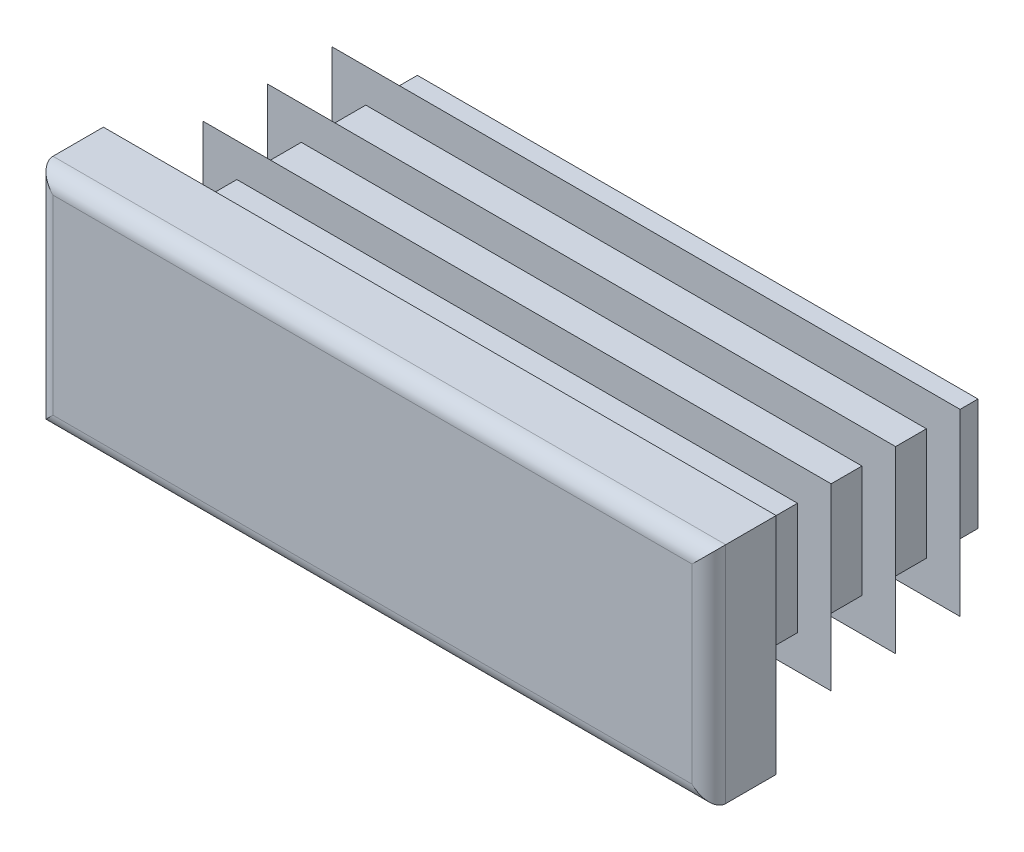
ISO-10303-21;
HEADER;
FILE_DESCRIPTION(('STEP AP214'),'2;1');
FILE_NAME('part.step','',(''),(''),'','','');
FILE_SCHEMA(('AUTOMOTIVE_DESIGN { 1 0 10303 214 1 1 1 1 }'));
ENDSEC;
DATA;
#1=APPLICATION_CONTEXT('core data for automotive mechanical design processes');
#2=APPLICATION_PROTOCOL_DEFINITION('international standard','automotive_design',2000,#1);
#3=PRODUCT_CONTEXT('',#1,'mechanical');
#4=PRODUCT('Part','Part','',(#3));
#5=PRODUCT_RELATED_PRODUCT_CATEGORY('part','',(#4));
#6=PRODUCT_DEFINITION_FORMATION('','',#4);
#7=PRODUCT_DEFINITION_CONTEXT('part definition',#1,'design');
#8=PRODUCT_DEFINITION('design','',#6,#7);
#9=PRODUCT_DEFINITION_SHAPE('','',#8);
#10=(LENGTH_UNIT() NAMED_UNIT(*) SI_UNIT(.MILLI.,.METRE.));
#11=(NAMED_UNIT(*) PLANE_ANGLE_UNIT() SI_UNIT($,.RADIAN.));
#12=(NAMED_UNIT(*) SI_UNIT($,.STERADIAN.) SOLID_ANGLE_UNIT());
#13=UNCERTAINTY_MEASURE_WITH_UNIT(LENGTH_MEASURE(1.E-05),#10,'distance_accuracy_value','');
#14=(GEOMETRIC_REPRESENTATION_CONTEXT(3) GLOBAL_UNCERTAINTY_ASSIGNED_CONTEXT((#13)) GLOBAL_UNIT_ASSIGNED_CONTEXT((#10,
#11,#12)) REPRESENTATION_CONTEXT('',''));
#15=CARTESIAN_POINT('',(0.,0.,0.));
#16=DIRECTION('',(0.,0.,1.));
#17=DIRECTION('',(1.,0.,0.));
#18=AXIS2_PLACEMENT_3D('',#15,#16,#17);
#19=CARTESIAN_POINT('',(14.25,-5.,3.));
#20=DIRECTION('',(0.,0.,-1.));
#21=DIRECTION('',(0.,1.,0.));
#22=AXIS2_PLACEMENT_3D('',#19,#20,#21);
#23=PLANE('',#22);
#24=DIRECTION('',(0.,1.,0.));
#25=VECTOR('',#24,1.);
#26=CARTESIAN_POINT('',(-14.25,-5.,3.));
#27=LINE('',#26,#25);
#28=CARTESIAN_POINT('',(-14.25,-4.25,3.));
#29=VERTEX_POINT('',#28);
#30=CARTESIAN_POINT('',(-14.25,4.25,3.));
#31=VERTEX_POINT('',#30);
#32=EDGE_CURVE('E310',#29,#31,#27,.T.);
#33=ORIENTED_EDGE('',*,*,#32,.F.);
#34=DIRECTION('',(-1.,0.,0.));
#35=VECTOR('',#34,1.);
#36=CARTESIAN_POINT('',(15.,-4.25,3.));
#37=LINE('',#36,#35);
#38=CARTESIAN_POINT('',(14.25,-4.25,3.));
#39=VERTEX_POINT('',#38);
#40=EDGE_CURVE('E482',#39,#29,#37,.T.);
#41=ORIENTED_EDGE('',*,*,#40,.F.);
#42=DIRECTION('',(0.,1.,0.));
#43=VECTOR('',#42,1.);
#44=CARTESIAN_POINT('',(14.25,-5.,3.));
#45=LINE('',#44,#43);
#46=CARTESIAN_POINT('',(14.25,4.25,3.));
#47=VERTEX_POINT('',#46);
#48=EDGE_CURVE('E305',#39,#47,#45,.T.);
#49=ORIENTED_EDGE('',*,*,#48,.T.);
#50=DIRECTION('',(-1.,0.,0.));
#51=VECTOR('',#50,1.);
#52=CARTESIAN_POINT('',(15.,4.25,3.));
#53=LINE('',#52,#51);
#54=EDGE_CURVE('E630',#47,#31,#53,.T.);
#55=ORIENTED_EDGE('',*,*,#54,.T.);
#56=EDGE_LOOP('',(#33,#41,#49,#55));
#57=FACE_BOUND('',#56,.T.);
#58=ADVANCED_FACE('F14',(#57),#23,.F.);
#59=CARTESIAN_POINT('',(-14.25,-5.,2.25));
#60=DIRECTION('',(0.,1.,0.));
#61=DIRECTION('',(-1.,0.,0.));
#62=AXIS2_PLACEMENT_3D('',#59,#60,#61);
#63=CYLINDRICAL_SURFACE('',#62,0.75);
#64=DIRECTION('',(0.,1.,0.));
#65=VECTOR('',#64,1.);
#66=CARTESIAN_POINT('',(-15.,-5.,2.25));
#67=LINE('',#66,#65);
#68=CARTESIAN_POINT('',(-15.,-5.,2.25));
#69=VERTEX_POINT('',#68);
#70=CARTESIAN_POINT('',(-15.,5.,2.25));
#71=VERTEX_POINT('',#70);
#72=EDGE_CURVE('E402',#69,#71,#67,.T.);
#73=ORIENTED_EDGE('',*,*,#72,.F.);
#74=CARTESIAN_POINT('',(-14.25,-4.25,2.25));
#75=DIRECTION('',(-0.707106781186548,0.707106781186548,0.));
#76=DIRECTION('',(0.707106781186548,0.707106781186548,0.));
#77=AXIS2_PLACEMENT_3D('',#74,#75,#76);
#78=ELLIPSE('',#77,1.06066017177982,0.75);
#79=EDGE_CURVE('E59',#69,#29,#78,.T.);
#80=ORIENTED_EDGE('',*,*,#79,.T.);
#81=ORIENTED_EDGE('',*,*,#32,.T.);
#82=CARTESIAN_POINT('',(-14.25,4.25,2.25));
#83=DIRECTION('',(0.707106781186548,0.707106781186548,0.));
#84=DIRECTION('',(-0.707106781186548,0.707106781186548,0.));
#85=AXIS2_PLACEMENT_3D('',#82,#83,#84);
#86=ELLIPSE('',#85,1.06066017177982,0.75);
#87=EDGE_CURVE('E306',#31,#71,#86,.F.);
#88=ORIENTED_EDGE('',*,*,#87,.T.);
#89=EDGE_LOOP('',(#73,#80,#81,#88));
#90=FACE_BOUND('',#89,.T.);
#91=ADVANCED_FACE('F16',(#90),#63,.T.);
#92=CARTESIAN_POINT('',(-15.,-5.,2.25));
#93=DIRECTION('',(1.,0.,0.));
#94=DIRECTION('',(0.,1.,0.));
#95=AXIS2_PLACEMENT_3D('',#92,#93,#94);
#96=PLANE('',#95);
#97=DIRECTION('',(0.,0.,-1.));
#98=VECTOR('',#97,1.);
#99=CARTESIAN_POINT('',(-15.,5.,2.25));
#100=LINE('',#99,#98);
#101=CARTESIAN_POINT('',(-15.,5.,0.));
#102=VERTEX_POINT('',#101);
#103=EDGE_CURVE('E615',#71,#102,#100,.T.);
#104=ORIENTED_EDGE('',*,*,#103,.T.);
#105=DIRECTION('',(0.,1.,0.));
#106=VECTOR('',#105,1.);
#107=CARTESIAN_POINT('',(-15.,-5.,0.));
#108=LINE('',#107,#106);
#109=CARTESIAN_POINT('',(-15.,-5.,0.));
#110=VERTEX_POINT('',#109);
#111=EDGE_CURVE('E400',#110,#102,#108,.T.);
#112=ORIENTED_EDGE('',*,*,#111,.F.);
#113=DIRECTION('',(0.,0.,-1.));
#114=VECTOR('',#113,1.);
#115=CARTESIAN_POINT('',(-15.,-5.,2.25));
#116=LINE('',#115,#114);
#117=EDGE_CURVE('E616',#69,#110,#116,.T.);
#118=ORIENTED_EDGE('',*,*,#117,.F.);
#119=ORIENTED_EDGE('',*,*,#72,.T.);
#120=EDGE_LOOP('',(#104,#112,#118,#119));
#121=FACE_BOUND('',#120,.T.);
#122=ADVANCED_FACE('F697',(#121),#96,.F.);
#123=CARTESIAN_POINT('',(-12.5,-5.,0.));
#124=DIRECTION('',(1.,0.,0.));
#125=DIRECTION('',(0.,1.,0.));
#126=AXIS2_PLACEMENT_3D('',#123,#124,#125);
#127=PLANE('',#126);
#128=DIRECTION('',(0.,1.,0.));
#129=VECTOR('',#128,1.);
#130=CARTESIAN_POINT('',(-12.5,-5.,0.));
#131=LINE('',#130,#129);
#132=CARTESIAN_POINT('',(-12.5,-2.5,0.));
#133=VERTEX_POINT('',#132);
#134=CARTESIAN_POINT('',(-12.5,2.5,0.));
#135=VERTEX_POINT('',#134);
#136=EDGE_CURVE('E397',#133,#135,#131,.T.);
#137=ORIENTED_EDGE('',*,*,#136,.T.);
#138=DIRECTION('',(0.,0.,-1.));
#139=VECTOR('',#138,1.);
#140=CARTESIAN_POINT('',(-12.5,2.5,0.));
#141=LINE('',#140,#139);
#142=CARTESIAN_POINT('',(-12.5,2.5,-0.575));
#143=VERTEX_POINT('',#142);
#144=EDGE_CURVE('E495',#135,#143,#141,.T.);
#145=ORIENTED_EDGE('',*,*,#144,.T.);
#146=DIRECTION('',(0.,1.,0.));
#147=VECTOR('',#146,1.);
#148=CARTESIAN_POINT('',(-12.5,-5.,-0.575));
#149=LINE('',#148,#147);
#150=CARTESIAN_POINT('',(-12.5,-2.5,-0.575));
#151=VERTEX_POINT('',#150);
#152=EDGE_CURVE('E394',#151,#143,#149,.T.);
#153=ORIENTED_EDGE('',*,*,#152,.F.);
#154=DIRECTION('',(0.,0.,1.));
#155=VECTOR('',#154,1.);
#156=CARTESIAN_POINT('',(-12.5,-2.5,0.));
#157=LINE('',#156,#155);
#158=EDGE_CURVE('E489',#151,#133,#157,.T.);
#159=ORIENTED_EDGE('',*,*,#158,.T.);
#160=EDGE_LOOP('',(#137,#145,#153,#159));
#161=FACE_BOUND('',#160,.T.);
#162=ADVANCED_FACE('F787',(#161),#127,.F.);
#163=CARTESIAN_POINT('',(-14.,-5.,-0.575));
#164=DIRECTION('',(0.342020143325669,0.,0.939692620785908));
#165=DIRECTION('',(-0.939692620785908,0.,0.342020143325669));
#166=AXIS2_PLACEMENT_3D('',#163,#164,#165);
#167=PLANE('',#166);
#168=DIRECTION('',(0.,1.,0.));
#169=VECTOR('',#168,1.);
#170=CARTESIAN_POINT('',(-14.,-5.,-0.575));
#171=LINE('',#170,#169);
#172=CARTESIAN_POINT('',(-14.,-4.,-0.575));
#173=VERTEX_POINT('',#172);
#174=CARTESIAN_POINT('',(-14.,4.,-0.575));
#175=VERTEX_POINT('',#174);
#176=EDGE_CURVE('E392',#173,#175,#171,.T.);
#177=ORIENTED_EDGE('',*,*,#176,.T.);
#178=DIRECTION('',(0.844349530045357,-0.438895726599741,-0.307318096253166));
#179=VECTOR('',#178,1.);
#180=CARTESIAN_POINT('',(-10.6647673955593,2.26633487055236,-1.78892539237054));
#181=LINE('',#180,#179);
#182=CARTESIAN_POINT('',(-12.5,3.22029495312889,-1.1209553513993));
#183=VERTEX_POINT('',#182);
#184=EDGE_CURVE('E519',#175,#183,#181,.T.);
#185=ORIENTED_EDGE('',*,*,#184,.T.);
#186=DIRECTION('',(0.,1.,0.));
#187=VECTOR('',#186,1.);
#188=CARTESIAN_POINT('',(-12.5,-5.,-1.1209553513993));
#189=LINE('',#188,#187);
#190=CARTESIAN_POINT('',(-12.5,-3.22029495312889,-1.1209553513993));
#191=VERTEX_POINT('',#190);
#192=EDGE_CURVE('E389',#191,#183,#189,.T.);
#193=ORIENTED_EDGE('',*,*,#192,.F.);
#194=DIRECTION('',(-0.844349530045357,-0.438895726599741,0.307318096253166));
#195=VECTOR('',#194,1.);
#196=CARTESIAN_POINT('',(-14.3705814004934,-4.19262945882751,-0.440119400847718));
#197=LINE('',#196,#195);
#198=EDGE_CURVE('E507',#191,#173,#197,.T.);
#199=ORIENTED_EDGE('',*,*,#198,.T.);
#200=EDGE_LOOP('',(#177,#185,#193,#199));
#201=FACE_BOUND('',#200,.T.);
#202=ADVANCED_FACE('F783',(#201),#167,.F.);
#203=CARTESIAN_POINT('',(-12.5,-5.,-1.1209553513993));
#204=DIRECTION('',(1.,0.,0.));
#205=DIRECTION('',(0.,1.,0.));
#206=AXIS2_PLACEMENT_3D('',#203,#204,#205);
#207=PLANE('',#206);
#208=ORIENTED_EDGE('',*,*,#192,.T.);
#209=DIRECTION('',(0.,-0.819152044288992,-0.573576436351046));
#210=VECTOR('',#209,1.);
#211=CARTESIAN_POINT('',(-12.5,-2.29560575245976,-4.98323060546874));
#212=LINE('',#211,#210);
#213=CARTESIAN_POINT('',(-12.5,2.5,-1.62531130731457));
#214=VERTEX_POINT('',#213);
#215=EDGE_CURVE('E516',#183,#214,#212,.T.);
#216=ORIENTED_EDGE('',*,*,#215,.T.);
#217=DIRECTION('',(0.,0.,-1.));
#218=VECTOR('',#217,1.);
#219=CARTESIAN_POINT('',(-12.5,2.5,-1.1209553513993));
#220=LINE('',#219,#218);
#221=CARTESIAN_POINT('',(-12.5,2.5,-3.45));
#222=VERTEX_POINT('',#221);
#223=EDGE_CURVE('E525',#214,#222,#220,.T.);
#224=ORIENTED_EDGE('',*,*,#223,.T.);
#225=DIRECTION('',(0.,1.,0.));
#226=VECTOR('',#225,1.);
#227=CARTESIAN_POINT('',(-12.5,-5.,-3.45));
#228=LINE('',#227,#226);
#229=CARTESIAN_POINT('',(-12.5,-2.5,-3.45));
#230=VERTEX_POINT('',#229);
#231=EDGE_CURVE('E386',#230,#222,#228,.T.);
#232=ORIENTED_EDGE('',*,*,#231,.F.);
#233=DIRECTION('',(0.,0.,1.));
#234=VECTOR('',#233,1.);
#235=CARTESIAN_POINT('',(-12.5,-2.5,-1.1209553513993));
#236=LINE('',#235,#234);
#237=CARTESIAN_POINT('',(-12.5,-2.5,-1.62531130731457));
#238=VERTEX_POINT('',#237);
#239=EDGE_CURVE('E522',#230,#238,#236,.T.);
#240=ORIENTED_EDGE('',*,*,#239,.T.);
#241=DIRECTION('',(0.,-0.819152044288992,0.573576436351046));
#242=VECTOR('',#241,1.);
#243=CARTESIAN_POINT('',(-12.5,-4.41449496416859,-0.284767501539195));
#244=LINE('',#243,#242);
#245=EDGE_CURVE('E504',#238,#191,#244,.T.);
#246=ORIENTED_EDGE('',*,*,#245,.T.);
#247=EDGE_LOOP('',(#208,#216,#224,#232,#240,#246));
#248=FACE_BOUND('',#247,.T.);
#249=ADVANCED_FACE('F779',(#248),#207,.F.);
#250=CARTESIAN_POINT('',(-14.,-5.,-3.45));
#251=DIRECTION('',(0.342020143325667,0.,0.939692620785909));
#252=DIRECTION('',(-0.939692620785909,0.,0.342020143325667));
#253=AXIS2_PLACEMENT_3D('',#250,#251,#252);
#254=PLANE('',#253);
#255=DIRECTION('',(0.,1.,0.));
#256=VECTOR('',#255,1.);
#257=CARTESIAN_POINT('',(-14.,-5.,-3.45));
#258=LINE('',#257,#256);
#259=CARTESIAN_POINT('',(-14.,-4.,-3.45));
#260=VERTEX_POINT('',#259);
#261=CARTESIAN_POINT('',(-14.,4.,-3.45));
#262=VERTEX_POINT('',#261);
#263=EDGE_CURVE('E384',#260,#262,#258,.T.);
#264=ORIENTED_EDGE('',*,*,#263,.T.);
#265=DIRECTION('',(0.844349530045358,-0.438895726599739,-0.307318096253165));
#266=VECTOR('',#265,1.);
#267=CARTESIAN_POINT('',(-10.6647673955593,2.26633487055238,-4.66392539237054));
#268=LINE('',#267,#266);
#269=CARTESIAN_POINT('',(-12.5,3.22029495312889,-3.99595535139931));
#270=VERTEX_POINT('',#269);
#271=EDGE_CURVE('E549',#262,#270,#268,.T.);
#272=ORIENTED_EDGE('',*,*,#271,.T.);
#273=DIRECTION('',(0.,1.,0.));
#274=VECTOR('',#273,1.);
#275=CARTESIAN_POINT('',(-12.5,-5.,-3.99595535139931));
#276=LINE('',#275,#274);
#277=CARTESIAN_POINT('',(-12.5,-3.22029495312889,-3.99595535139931));
#278=VERTEX_POINT('',#277);
#279=EDGE_CURVE('E381',#278,#270,#276,.T.);
#280=ORIENTED_EDGE('',*,*,#279,.F.);
#281=DIRECTION('',(-0.844349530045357,-0.43889572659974,0.307318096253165));
#282=VECTOR('',#281,1.);
#283=CARTESIAN_POINT('',(-14.3705814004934,-4.19262945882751,-3.31511940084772));
#284=LINE('',#283,#282);
#285=EDGE_CURVE('E537',#278,#260,#284,.T.);
#286=ORIENTED_EDGE('',*,*,#285,.T.);
#287=EDGE_LOOP('',(#264,#272,#280,#286));
#288=FACE_BOUND('',#287,.T.);
#289=ADVANCED_FACE('F775',(#288),#254,.F.);
#290=CARTESIAN_POINT('',(-12.5,-5.,-3.99595535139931));
#291=DIRECTION('',(1.,0.,0.));
#292=DIRECTION('',(0.,1.,0.));
#293=AXIS2_PLACEMENT_3D('',#290,#291,#292);
#294=PLANE('',#293);
#295=ORIENTED_EDGE('',*,*,#279,.T.);
#296=DIRECTION('',(0.,-0.819152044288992,-0.573576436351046));
#297=VECTOR('',#296,1.);
#298=CARTESIAN_POINT('',(-12.5,-2.29560575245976,-7.85823060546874));
#299=LINE('',#298,#297);
#300=CARTESIAN_POINT('',(-12.5,2.5,-4.50031130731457));
#301=VERTEX_POINT('',#300);
#302=EDGE_CURVE('E546',#270,#301,#299,.T.);
#303=ORIENTED_EDGE('',*,*,#302,.T.);
#304=DIRECTION('',(0.,0.,-1.));
#305=VECTOR('',#304,1.);
#306=CARTESIAN_POINT('',(-12.5,2.5,-3.99595535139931));
#307=LINE('',#306,#305);
#308=CARTESIAN_POINT('',(-12.5,2.5,-6.325));
#309=VERTEX_POINT('',#308);
#310=EDGE_CURVE('E555',#301,#309,#307,.T.);
#311=ORIENTED_EDGE('',*,*,#310,.T.);
#312=DIRECTION('',(0.,1.,0.));
#313=VECTOR('',#312,1.);
#314=CARTESIAN_POINT('',(-12.5,-5.,-6.325));
#315=LINE('',#314,#313);
#316=CARTESIAN_POINT('',(-12.5,-2.5,-6.325));
#317=VERTEX_POINT('',#316);
#318=EDGE_CURVE('E378',#317,#309,#315,.T.);
#319=ORIENTED_EDGE('',*,*,#318,.F.);
#320=DIRECTION('',(0.,0.,1.));
#321=VECTOR('',#320,1.);
#322=CARTESIAN_POINT('',(-12.5,-2.5,-3.99595535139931));
#323=LINE('',#322,#321);
#324=CARTESIAN_POINT('',(-12.5,-2.5,-4.50031130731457));
#325=VERTEX_POINT('',#324);
#326=EDGE_CURVE('E552',#317,#325,#323,.T.);
#327=ORIENTED_EDGE('',*,*,#326,.T.);
#328=DIRECTION('',(0.,-0.819152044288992,0.573576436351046));
#329=VECTOR('',#328,1.);
#330=CARTESIAN_POINT('',(-12.5,-4.41449496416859,-3.1597675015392));
#331=LINE('',#330,#329);
#332=EDGE_CURVE('E534',#325,#278,#331,.T.);
#333=ORIENTED_EDGE('',*,*,#332,.T.);
#334=EDGE_LOOP('',(#295,#303,#311,#319,#327,#333));
#335=FACE_BOUND('',#334,.T.);
#336=ADVANCED_FACE('F771',(#335),#294,.F.);
#337=CARTESIAN_POINT('',(-14.,-5.,-6.325));
#338=DIRECTION('',(0.342020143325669,0.,0.939692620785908));
#339=DIRECTION('',(-0.939692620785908,0.,0.342020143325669));
#340=AXIS2_PLACEMENT_3D('',#337,#338,#339);
#341=PLANE('',#340);
#342=DIRECTION('',(0.,1.,0.));
#343=VECTOR('',#342,1.);
#344=CARTESIAN_POINT('',(-14.,-5.,-6.325));
#345=LINE('',#344,#343);
#346=CARTESIAN_POINT('',(-14.,-4.,-6.325));
#347=VERTEX_POINT('',#346);
#348=CARTESIAN_POINT('',(-14.,4.,-6.325));
#349=VERTEX_POINT('',#348);
#350=EDGE_CURVE('E376',#347,#349,#345,.T.);
#351=ORIENTED_EDGE('',*,*,#350,.T.);
#352=DIRECTION('',(0.844349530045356,-0.438895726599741,-0.307318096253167));
#353=VECTOR('',#352,1.);
#354=CARTESIAN_POINT('',(-10.6647673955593,2.26633487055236,-7.53892539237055));
#355=LINE('',#354,#353);
#356=CARTESIAN_POINT('',(-12.5,3.22029495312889,-6.8709553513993));
#357=VERTEX_POINT('',#356);
#358=EDGE_CURVE('E579',#349,#357,#355,.T.);
#359=ORIENTED_EDGE('',*,*,#358,.T.);
#360=DIRECTION('',(0.,1.,0.));
#361=VECTOR('',#360,1.);
#362=CARTESIAN_POINT('',(-12.5,-5.,-6.8709553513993));
#363=LINE('',#362,#361);
#364=CARTESIAN_POINT('',(-12.5,-3.22029495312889,-6.8709553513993));
#365=VERTEX_POINT('',#364);
#366=EDGE_CURVE('E373',#365,#357,#363,.T.);
#367=ORIENTED_EDGE('',*,*,#366,.F.);
#368=DIRECTION('',(-0.844349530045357,-0.43889572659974,0.307318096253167));
#369=VECTOR('',#368,1.);
#370=CARTESIAN_POINT('',(-14.3705814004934,-4.19262945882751,-6.19011940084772));
#371=LINE('',#370,#369);
#372=EDGE_CURVE('E567',#365,#347,#371,.T.);
#373=ORIENTED_EDGE('',*,*,#372,.T.);
#374=EDGE_LOOP('',(#351,#359,#367,#373));
#375=FACE_BOUND('',#374,.T.);
#376=ADVANCED_FACE('F767',(#375),#341,.F.);
#377=CARTESIAN_POINT('',(-12.5,-5.,-6.8709553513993));
#378=DIRECTION('',(1.,0.,0.));
#379=DIRECTION('',(0.,1.,0.));
#380=AXIS2_PLACEMENT_3D('',#377,#378,#379);
#381=PLANE('',#380);
#382=ORIENTED_EDGE('',*,*,#366,.T.);
#383=DIRECTION('',(0.,-0.819152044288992,-0.573576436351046));
#384=VECTOR('',#383,1.);
#385=CARTESIAN_POINT('',(-12.5,-2.29560575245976,-10.7332306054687));
#386=LINE('',#385,#384);
#387=CARTESIAN_POINT('',(-12.5,2.5,-7.37531130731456));
#388=VERTEX_POINT('',#387);
#389=EDGE_CURVE('E576',#357,#388,#386,.T.);
#390=ORIENTED_EDGE('',*,*,#389,.T.);
#391=DIRECTION('',(0.,0.,-1.));
#392=VECTOR('',#391,1.);
#393=CARTESIAN_POINT('',(-12.5,2.5,-6.8709553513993));
#394=LINE('',#393,#392);
#395=CARTESIAN_POINT('',(-12.5,2.5,-9.2));
#396=VERTEX_POINT('',#395);
#397=EDGE_CURVE('E585',#388,#396,#394,.T.);
#398=ORIENTED_EDGE('',*,*,#397,.T.);
#399=DIRECTION('',(0.,1.,0.));
#400=VECTOR('',#399,1.);
#401=CARTESIAN_POINT('',(-12.5,-5.,-9.2));
#402=LINE('',#401,#400);
#403=CARTESIAN_POINT('',(-12.5,-2.5,-9.2));
#404=VERTEX_POINT('',#403);
#405=EDGE_CURVE('E370',#404,#396,#402,.T.);
#406=ORIENTED_EDGE('',*,*,#405,.F.);
#407=DIRECTION('',(0.,0.,1.));
#408=VECTOR('',#407,1.);
#409=CARTESIAN_POINT('',(-12.5,-2.5,-6.8709553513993));
#410=LINE('',#409,#408);
#411=CARTESIAN_POINT('',(-12.5,-2.5,-7.37531130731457));
#412=VERTEX_POINT('',#411);
#413=EDGE_CURVE('E582',#404,#412,#410,.T.);
#414=ORIENTED_EDGE('',*,*,#413,.T.);
#415=DIRECTION('',(0.,-0.819152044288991,0.573576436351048));
#416=VECTOR('',#415,1.);
#417=CARTESIAN_POINT('',(-12.5,-4.41449496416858,-6.03476750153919));
#418=LINE('',#417,#416);
#419=EDGE_CURVE('E564',#412,#365,#418,.T.);
#420=ORIENTED_EDGE('',*,*,#419,.T.);
#421=EDGE_LOOP('',(#382,#390,#398,#406,#414,#420));
#422=FACE_BOUND('',#421,.T.);
#423=ADVANCED_FACE('F764',(#422),#381,.F.);
#424=CARTESIAN_POINT('',(-14.,-5.,-9.2));
#425=DIRECTION('',(0.342020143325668,0.,0.939692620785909));
#426=DIRECTION('',(-0.939692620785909,0.,0.342020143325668));
#427=AXIS2_PLACEMENT_3D('',#424,#425,#426);
#428=PLANE('',#427);
#429=DIRECTION('',(0.,1.,0.));
#430=VECTOR('',#429,1.);
#431=CARTESIAN_POINT('',(-14.,-5.,-9.2));
#432=LINE('',#431,#430);
#433=CARTESIAN_POINT('',(-14.,-4.,-9.2));
#434=VERTEX_POINT('',#433);
#435=CARTESIAN_POINT('',(-14.,4.,-9.2));
#436=VERTEX_POINT('',#435);
#437=EDGE_CURVE('E368',#434,#436,#432,.T.);
#438=ORIENTED_EDGE('',*,*,#437,.T.);
#439=DIRECTION('',(0.844349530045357,-0.438895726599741,-0.307318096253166));
#440=VECTOR('',#439,1.);
#441=CARTESIAN_POINT('',(-10.6647673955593,2.26633487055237,-10.4139253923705));
#442=LINE('',#441,#440);
#443=CARTESIAN_POINT('',(-12.5,3.22029495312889,-9.7459553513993));
#444=VERTEX_POINT('',#443);
#445=EDGE_CURVE('E607',#436,#444,#442,.T.);
#446=ORIENTED_EDGE('',*,*,#445,.T.);
#447=DIRECTION('',(0.,1.,0.));
#448=VECTOR('',#447,1.);
#449=CARTESIAN_POINT('',(-12.5,-5.,-9.7459553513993));
#450=LINE('',#449,#448);
#451=CARTESIAN_POINT('',(-12.5,-3.22029495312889,-9.7459553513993));
#452=VERTEX_POINT('',#451);
#453=EDGE_CURVE('E365',#452,#444,#450,.T.);
#454=ORIENTED_EDGE('',*,*,#453,.F.);
#455=DIRECTION('',(-0.844349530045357,-0.438895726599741,0.307318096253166));
#456=VECTOR('',#455,1.);
#457=CARTESIAN_POINT('',(-14.3705814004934,-4.19262945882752,-9.06511940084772));
#458=LINE('',#457,#456);
#459=EDGE_CURVE('E595',#452,#434,#458,.T.);
#460=ORIENTED_EDGE('',*,*,#459,.T.);
#461=EDGE_LOOP('',(#438,#446,#454,#460));
#462=FACE_BOUND('',#461,.T.);
#463=ADVANCED_FACE('F675',(#462),#428,.F.);
#464=CARTESIAN_POINT('',(-12.5,-5.,-9.7459553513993));
#465=DIRECTION('',(1.,0.,0.));
#466=DIRECTION('',(0.,1.,0.));
#467=AXIS2_PLACEMENT_3D('',#464,#465,#466);
#468=PLANE('',#467);
#469=ORIENTED_EDGE('',*,*,#453,.T.);
#470=DIRECTION('',(0.,-0.819152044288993,-0.573576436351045));
#471=VECTOR('',#470,1.);
#472=CARTESIAN_POINT('',(-12.5,-2.29560575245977,-13.6082306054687));
#473=LINE('',#472,#471);
#474=CARTESIAN_POINT('',(-12.5,2.5,-10.2503113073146));
#475=VERTEX_POINT('',#474);
#476=EDGE_CURVE('E604',#444,#475,#473,.T.);
#477=ORIENTED_EDGE('',*,*,#476,.T.);
#478=DIRECTION('',(0.,0.,-1.));
#479=VECTOR('',#478,1.);
#480=CARTESIAN_POINT('',(-12.5,2.5,-9.7459553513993));
#481=LINE('',#480,#479);
#482=CARTESIAN_POINT('',(-12.5,2.5,-11.5));
#483=VERTEX_POINT('',#482);
#484=EDGE_CURVE('E613',#475,#483,#481,.T.);
#485=ORIENTED_EDGE('',*,*,#484,.T.);
#486=DIRECTION('',(0.,1.,0.));
#487=VECTOR('',#486,1.);
#488=CARTESIAN_POINT('',(-12.5,-5.,-11.5));
#489=LINE('',#488,#487);
#490=CARTESIAN_POINT('',(-12.5,-2.5,-11.5));
#491=VERTEX_POINT('',#490);
#492=EDGE_CURVE('E362',#491,#483,#489,.T.);
#493=ORIENTED_EDGE('',*,*,#492,.F.);
#494=DIRECTION('',(0.,0.,1.));
#495=VECTOR('',#494,1.);
#496=CARTESIAN_POINT('',(-12.5,-2.5,-9.7459553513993));
#497=LINE('',#496,#495);
#498=CARTESIAN_POINT('',(-12.5,-2.5,-10.2503113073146));
#499=VERTEX_POINT('',#498);
#500=EDGE_CURVE('E610',#491,#499,#497,.T.);
#501=ORIENTED_EDGE('',*,*,#500,.T.);
#502=DIRECTION('',(0.,-0.819152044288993,0.573576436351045));
#503=VECTOR('',#502,1.);
#504=CARTESIAN_POINT('',(-12.5,-4.41449496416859,-8.9097675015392));
#505=LINE('',#504,#503);
#506=EDGE_CURVE('E592',#499,#452,#505,.T.);
#507=ORIENTED_EDGE('',*,*,#506,.T.);
#508=EDGE_LOOP('',(#469,#477,#485,#493,#501,#507));
#509=FACE_BOUND('',#508,.T.);
#510=ADVANCED_FACE('F677',(#509),#468,.F.);
#511=CARTESIAN_POINT('',(-12.5,-5.,-11.5));
#512=DIRECTION('',(0.,0.,1.));
#513=DIRECTION('',(0.,-1.,0.));
#514=AXIS2_PLACEMENT_3D('',#511,#512,#513);
#515=PLANE('',#514);
#516=ORIENTED_EDGE('',*,*,#492,.T.);
#517=DIRECTION('',(-1.,0.,0.));
#518=VECTOR('',#517,1.);
#519=CARTESIAN_POINT('',(15.,2.5,-11.5));
#520=LINE('',#519,#518);
#521=CARTESIAN_POINT('',(12.5,2.5,-11.5));
#522=VERTEX_POINT('',#521);
#523=EDGE_CURVE('E438',#522,#483,#520,.T.);
#524=ORIENTED_EDGE('',*,*,#523,.F.);
#525=DIRECTION('',(0.,1.,0.));
#526=VECTOR('',#525,1.);
#527=CARTESIAN_POINT('',(12.5,-5.,-11.5));
#528=LINE('',#527,#526);
#529=CARTESIAN_POINT('',(12.5,-2.5,-11.5));
#530=VERTEX_POINT('',#529);
#531=EDGE_CURVE('E359',#530,#522,#528,.T.);
#532=ORIENTED_EDGE('',*,*,#531,.F.);
#533=DIRECTION('',(-1.,0.,0.));
#534=VECTOR('',#533,1.);
#535=CARTESIAN_POINT('',(15.,-2.5,-11.5));
#536=LINE('',#535,#534);
#537=EDGE_CURVE('E436',#530,#491,#536,.T.);
#538=ORIENTED_EDGE('',*,*,#537,.T.);
#539=EDGE_LOOP('',(#516,#524,#532,#538));
#540=FACE_BOUND('',#539,.T.);
#541=ADVANCED_FACE('F435',(#540),#515,.F.);
#542=CARTESIAN_POINT('',(12.5,-5.,-11.5));
#543=DIRECTION('',(-1.,0.,0.));
#544=DIRECTION('',(0.,-1.,0.));
#545=AXIS2_PLACEMENT_3D('',#542,#543,#544);
#546=PLANE('',#545);
#547=DIRECTION('',(0.,0.,1.));
#548=VECTOR('',#547,1.);
#549=CARTESIAN_POINT('',(12.5,2.5,-11.5));
#550=LINE('',#549,#548);
#551=CARTESIAN_POINT('',(12.5,2.5,-10.2503113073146));
#552=VERTEX_POINT('',#551);
#553=EDGE_CURVE('E9',#522,#552,#550,.T.);
#554=ORIENTED_EDGE('',*,*,#553,.T.);
#555=DIRECTION('',(0.,0.819152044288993,0.573576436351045));
#556=VECTOR('',#555,1.);
#557=CARTESIAN_POINT('',(12.5,-3.11973715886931,-14.1852936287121));
#558=LINE('',#557,#556);
#559=CARTESIAN_POINT('',(12.5,3.22029495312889,-9.7459553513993));
#560=VERTEX_POINT('',#559);
#561=EDGE_CURVE('E601',#552,#560,#558,.T.);
#562=ORIENTED_EDGE('',*,*,#561,.T.);
#563=DIRECTION('',(0.,1.,0.));
#564=VECTOR('',#563,1.);
#565=CARTESIAN_POINT('',(12.5,-5.,-9.7459553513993));
#566=LINE('',#565,#564);
#567=CARTESIAN_POINT('',(12.5,-3.22029495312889,-9.7459553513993));
#568=VERTEX_POINT('',#567);
#569=EDGE_CURVE('E356',#568,#560,#566,.T.);
#570=ORIENTED_EDGE('',*,*,#569,.F.);
#571=DIRECTION('',(0.,0.819152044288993,-0.573576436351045));
#572=VECTOR('',#571,1.);
#573=CARTESIAN_POINT('',(12.5,-3.59036355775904,-9.48683052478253));
#574=LINE('',#573,#572);
#575=CARTESIAN_POINT('',(12.5,-2.5,-10.2503113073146));
#576=VERTEX_POINT('',#575);
#577=EDGE_CURVE('E428',#568,#576,#574,.T.);
#578=ORIENTED_EDGE('',*,*,#577,.T.);
#579=DIRECTION('',(0.,0.,-1.));
#580=VECTOR('',#579,1.);
#581=CARTESIAN_POINT('',(12.5,-2.5,-11.5));
#582=LINE('',#581,#580);
#583=EDGE_CURVE('E23',#576,#530,#582,.T.);
#584=ORIENTED_EDGE('',*,*,#583,.T.);
#585=ORIENTED_EDGE('',*,*,#531,.T.);
#586=EDGE_LOOP('',(#554,#562,#570,#578,#584,#585));
#587=FACE_BOUND('',#586,.T.);
#588=ADVANCED_FACE('F426',(#587),#546,.F.);
#589=CARTESIAN_POINT('',(12.5,-5.,-9.7459553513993));
#590=DIRECTION('',(-0.342020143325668,0.,0.939692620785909));
#591=DIRECTION('',(-0.939692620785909,0.,-0.342020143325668));
#592=AXIS2_PLACEMENT_3D('',#589,#590,#591);
#593=PLANE('',#592);
#594=ORIENTED_EDGE('',*,*,#569,.T.);
#595=DIRECTION('',(0.844349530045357,0.438895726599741,0.307318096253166));
#596=VECTOR('',#595,1.);
#597=CARTESIAN_POINT('',(9.45371158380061,1.63682398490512,-10.8547136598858));
#598=LINE('',#597,#596);
#599=CARTESIAN_POINT('',(14.,4.,-9.2));
#600=VERTEX_POINT('',#599);
#601=EDGE_CURVE('E598',#560,#600,#598,.T.);
#602=ORIENTED_EDGE('',*,*,#601,.T.);
#603=DIRECTION('',(0.,1.,0.));
#604=VECTOR('',#603,1.);
#605=CARTESIAN_POINT('',(14.,-5.,-9.2));
#606=LINE('',#605,#604);
#607=CARTESIAN_POINT('',(14.,-4.,-9.2));
#608=VERTEX_POINT('',#607);
#609=EDGE_CURVE('E353',#608,#600,#606,.T.);
#610=ORIENTED_EDGE('',*,*,#609,.F.);
#611=DIRECTION('',(-0.844349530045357,0.438895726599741,-0.307318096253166));
#612=VECTOR('',#611,1.);
#613=CARTESIAN_POINT('',(13.1595255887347,-3.56311857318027,-9.50590766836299));
#614=LINE('',#613,#612);
#615=EDGE_CURVE('E588',#608,#568,#614,.T.);
#616=ORIENTED_EDGE('',*,*,#615,.T.);
#617=EDGE_LOOP('',(#594,#602,#610,#616));
#618=FACE_BOUND('',#617,.T.);
#619=ADVANCED_FACE('F752',(#618),#593,.F.);
#620=CARTESIAN_POINT('',(14.,-5.,-9.2));
#621=DIRECTION('',(0.,0.,-1.));
#622=DIRECTION('',(0.,1.,0.));
#623=AXIS2_PLACEMENT_3D('',#620,#621,#622);
#624=PLANE('',#623);
#625=ORIENTED_EDGE('',*,*,#609,.T.);
#626=DIRECTION('',(-1.,0.,0.));
#627=VECTOR('',#626,1.);
#628=CARTESIAN_POINT('',(15.,4.,-9.2));
#629=LINE('',#628,#627);
#630=EDGE_CURVE('E444',#600,#436,#629,.T.);
#631=ORIENTED_EDGE('',*,*,#630,.T.);
#632=ORIENTED_EDGE('',*,*,#437,.F.);
#633=DIRECTION('',(-1.,0.,0.));
#634=VECTOR('',#633,1.);
#635=CARTESIAN_POINT('',(15.,-4.,-9.2));
#636=LINE('',#635,#634);
#637=EDGE_CURVE('E451',#608,#434,#636,.T.);
#638=ORIENTED_EDGE('',*,*,#637,.F.);
#639=EDGE_LOOP('',(#625,#631,#632,#638));
#640=FACE_BOUND('',#639,.T.);
#641=ORIENTED_EDGE('',*,*,#405,.T.);
#642=DIRECTION('',(-1.,0.,0.));
#643=VECTOR('',#642,1.);
#644=CARTESIAN_POINT('',(15.,2.5,-9.2));
#645=LINE('',#644,#643);
#646=CARTESIAN_POINT('',(12.5,2.5,-9.2));
#647=VERTEX_POINT('',#646);
#648=EDGE_CURVE('E663',#647,#396,#645,.T.);
#649=ORIENTED_EDGE('',*,*,#648,.F.);
#650=DIRECTION('',(0.,1.,0.));
#651=VECTOR('',#650,1.);
#652=CARTESIAN_POINT('',(12.5,-5.,-9.2));
#653=LINE('',#652,#651);
#654=CARTESIAN_POINT('',(12.5,-2.5,-9.2));
#655=VERTEX_POINT('',#654);
#656=EDGE_CURVE('E350',#655,#647,#653,.T.);
#657=ORIENTED_EDGE('',*,*,#656,.F.);
#658=DIRECTION('',(-1.,0.,0.));
#659=VECTOR('',#658,1.);
#660=CARTESIAN_POINT('',(15.,-2.5,-9.2));
#661=LINE('',#660,#659);
#662=EDGE_CURVE('E453',#655,#404,#661,.T.);
#663=ORIENTED_EDGE('',*,*,#662,.T.);
#664=EDGE_LOOP('',(#641,#649,#657,#663));
#665=FACE_BOUND('',#664,.T.);
#666=ADVANCED_FACE('F667',(#640,#665),#624,.F.);
#667=CARTESIAN_POINT('',(12.5,-5.,-9.2));
#668=DIRECTION('',(-1.,0.,0.));
#669=DIRECTION('',(0.,-1.,0.));
#670=AXIS2_PLACEMENT_3D('',#667,#668,#669);
#671=PLANE('',#670);
#672=DIRECTION('',(0.,0.,1.));
#673=VECTOR('',#672,1.);
#674=CARTESIAN_POINT('',(12.5,2.5,-9.2));
#675=LINE('',#674,#673);
#676=CARTESIAN_POINT('',(12.5,2.5,-7.37531130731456));
#677=VERTEX_POINT('',#676);
#678=EDGE_CURVE('E420',#647,#677,#675,.T.);
#679=ORIENTED_EDGE('',*,*,#678,.T.);
#680=DIRECTION('',(0.,0.819152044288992,0.573576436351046));
#681=VECTOR('',#680,1.);
#682=CARTESIAN_POINT('',(12.5,-3.38989878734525,-11.4994628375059));
#683=LINE('',#682,#681);
#684=CARTESIAN_POINT('',(12.5,3.22029495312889,-6.8709553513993));
#685=VERTEX_POINT('',#684);
#686=EDGE_CURVE('E573',#677,#685,#683,.T.);
#687=ORIENTED_EDGE('',*,*,#686,.T.);
#688=DIRECTION('',(0.,1.,0.));
#689=VECTOR('',#688,1.);
#690=CARTESIAN_POINT('',(12.5,-5.,-6.8709553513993));
#691=LINE('',#690,#689);
#692=CARTESIAN_POINT('',(12.5,-3.22029495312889,-6.8709553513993));
#693=VERTEX_POINT('',#692);
#694=EDGE_CURVE('E347',#693,#685,#691,.T.);
#695=ORIENTED_EDGE('',*,*,#694,.F.);
#696=DIRECTION('',(0.,0.819152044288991,-0.573576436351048));
#697=VECTOR('',#696,1.);
#698=CARTESIAN_POINT('',(12.5,-3.32020192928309,-6.8009997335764));
#699=LINE('',#698,#697);
#700=CARTESIAN_POINT('',(12.5,-2.5,-7.37531130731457));
#701=VERTEX_POINT('',#700);
#702=EDGE_CURVE('E561',#693,#701,#699,.T.);
#703=ORIENTED_EDGE('',*,*,#702,.T.);
#704=DIRECTION('',(0.,0.,-1.));
#705=VECTOR('',#704,1.);
#706=CARTESIAN_POINT('',(12.5,-2.5,-9.2));
#707=LINE('',#706,#705);
#708=EDGE_CURVE('E417',#701,#655,#707,.T.);
#709=ORIENTED_EDGE('',*,*,#708,.T.);
#710=ORIENTED_EDGE('',*,*,#656,.T.);
#711=EDGE_LOOP('',(#679,#687,#695,#703,#709,#710));
#712=FACE_BOUND('',#711,.T.);
#713=ADVANCED_FACE('F745',(#712),#671,.F.);
#714=CARTESIAN_POINT('',(12.5,-5.,-6.8709553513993));
#715=DIRECTION('',(-0.342020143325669,0.,0.939692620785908));
#716=DIRECTION('',(-0.939692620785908,0.,-0.342020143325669));
#717=AXIS2_PLACEMENT_3D('',#714,#715,#716);
#718=PLANE('',#717);
#719=ORIENTED_EDGE('',*,*,#694,.T.);
#720=DIRECTION('',(0.844349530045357,0.43889572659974,0.307318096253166));
#721=VECTOR('',#720,1.);
#722=CARTESIAN_POINT('',(9.45371158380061,1.63682398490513,-7.97971365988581));
#723=LINE('',#722,#721);
#724=CARTESIAN_POINT('',(14.,4.,-6.325));
#725=VERTEX_POINT('',#724);
#726=EDGE_CURVE('E570',#685,#725,#723,.T.);
#727=ORIENTED_EDGE('',*,*,#726,.T.);
#728=DIRECTION('',(0.,1.,0.));
#729=VECTOR('',#728,1.);
#730=CARTESIAN_POINT('',(14.,-5.,-6.325));
#731=LINE('',#730,#729);
#732=CARTESIAN_POINT('',(14.,-4.,-6.325));
#733=VERTEX_POINT('',#732);
#734=EDGE_CURVE('E344',#733,#725,#731,.T.);
#735=ORIENTED_EDGE('',*,*,#734,.F.);
#736=DIRECTION('',(-0.844349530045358,0.438895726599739,-0.307318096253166));
#737=VECTOR('',#736,1.);
#738=CARTESIAN_POINT('',(13.1595255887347,-3.56311857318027,-6.63090766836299));
#739=LINE('',#738,#737);
#740=EDGE_CURVE('E558',#733,#693,#739,.T.);
#741=ORIENTED_EDGE('',*,*,#740,.T.);
#742=EDGE_LOOP('',(#719,#727,#735,#741));
#743=FACE_BOUND('',#742,.T.);
#744=ADVANCED_FACE('F741',(#743),#718,.F.);
#745=CARTESIAN_POINT('',(14.,-5.,-6.325));
#746=DIRECTION('',(0.,0.,-1.));
#747=DIRECTION('',(0.,1.,0.));
#748=AXIS2_PLACEMENT_3D('',#745,#746,#747);
#749=PLANE('',#748);
#750=ORIENTED_EDGE('',*,*,#734,.T.);
#751=DIRECTION('',(-1.,0.,0.));
#752=VECTOR('',#751,1.);
#753=CARTESIAN_POINT('',(15.,4.,-6.325));
#754=LINE('',#753,#752);
#755=EDGE_CURVE('E657',#725,#349,#754,.T.);
#756=ORIENTED_EDGE('',*,*,#755,.T.);
#757=ORIENTED_EDGE('',*,*,#350,.F.);
#758=DIRECTION('',(-1.,0.,0.));
#759=VECTOR('',#758,1.);
#760=CARTESIAN_POINT('',(15.,-4.,-6.325));
#761=LINE('',#760,#759);
#762=EDGE_CURVE('E459',#733,#347,#761,.T.);
#763=ORIENTED_EDGE('',*,*,#762,.F.);
#764=EDGE_LOOP('',(#750,#756,#757,#763));
#765=FACE_BOUND('',#764,.T.);
#766=ORIENTED_EDGE('',*,*,#318,.T.);
#767=DIRECTION('',(-1.,0.,0.));
#768=VECTOR('',#767,1.);
#769=CARTESIAN_POINT('',(15.,2.5,-6.325));
#770=LINE('',#769,#768);
#771=CARTESIAN_POINT('',(12.5,2.5,-6.325));
#772=VERTEX_POINT('',#771);
#773=EDGE_CURVE('E655',#772,#309,#770,.T.);
#774=ORIENTED_EDGE('',*,*,#773,.F.);
#775=DIRECTION('',(0.,1.,0.));
#776=VECTOR('',#775,1.);
#777=CARTESIAN_POINT('',(12.5,-5.,-6.325));
#778=LINE('',#777,#776);
#779=CARTESIAN_POINT('',(12.5,-2.5,-6.325));
#780=VERTEX_POINT('',#779);
#781=EDGE_CURVE('E341',#780,#772,#778,.T.);
#782=ORIENTED_EDGE('',*,*,#781,.F.);
#783=DIRECTION('',(-1.,0.,0.));
#784=VECTOR('',#783,1.);
#785=CARTESIAN_POINT('',(15.,-2.5,-6.325));
#786=LINE('',#785,#784);
#787=EDGE_CURVE('E461',#780,#317,#786,.T.);
#788=ORIENTED_EDGE('',*,*,#787,.T.);
#789=EDGE_LOOP('',(#766,#774,#782,#788));
#790=FACE_BOUND('',#789,.T.);
#791=ADVANCED_FACE('F737',(#765,#790),#749,.F.);
#792=CARTESIAN_POINT('',(12.5,-5.,-6.325));
#793=DIRECTION('',(-1.,0.,0.));
#794=DIRECTION('',(0.,-1.,0.));
#795=AXIS2_PLACEMENT_3D('',#792,#793,#794);
#796=PLANE('',#795);
#797=DIRECTION('',(0.,0.,1.));
#798=VECTOR('',#797,1.);
#799=CARTESIAN_POINT('',(12.5,2.5,-6.325));
#800=LINE('',#799,#798);
#801=CARTESIAN_POINT('',(12.5,2.5,-4.50031130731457));
#802=VERTEX_POINT('',#801);
#803=EDGE_CURVE('E414',#772,#802,#800,.T.);
#804=ORIENTED_EDGE('',*,*,#803,.T.);
#805=DIRECTION('',(0.,0.819152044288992,0.573576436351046));
#806=VECTOR('',#805,1.);
#807=CARTESIAN_POINT('',(12.5,-3.38989878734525,-8.62446283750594));
#808=LINE('',#807,#806);
#809=CARTESIAN_POINT('',(12.5,3.22029495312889,-3.99595535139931));
#810=VERTEX_POINT('',#809);
#811=EDGE_CURVE('E543',#802,#810,#808,.T.);
#812=ORIENTED_EDGE('',*,*,#811,.T.);
#813=DIRECTION('',(0.,1.,0.));
#814=VECTOR('',#813,1.);
#815=CARTESIAN_POINT('',(12.5,-5.,-3.99595535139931));
#816=LINE('',#815,#814);
#817=CARTESIAN_POINT('',(12.5,-3.22029495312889,-3.99595535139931));
#818=VERTEX_POINT('',#817);
#819=EDGE_CURVE('E338',#818,#810,#816,.T.);
#820=ORIENTED_EDGE('',*,*,#819,.F.);
#821=DIRECTION('',(0.,0.819152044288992,-0.573576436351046));
#822=VECTOR('',#821,1.);
#823=CARTESIAN_POINT('',(12.5,-3.32020192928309,-3.9259997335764));
#824=LINE('',#823,#822);
#825=CARTESIAN_POINT('',(12.5,-2.5,-4.50031130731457));
#826=VERTEX_POINT('',#825);
#827=EDGE_CURVE('E531',#818,#826,#824,.T.);
#828=ORIENTED_EDGE('',*,*,#827,.T.);
#829=DIRECTION('',(0.,0.,-1.));
#830=VECTOR('',#829,1.);
#831=CARTESIAN_POINT('',(12.5,-2.5,-6.325));
#832=LINE('',#831,#830);
#833=EDGE_CURVE('E411',#826,#780,#832,.T.);
#834=ORIENTED_EDGE('',*,*,#833,.T.);
#835=ORIENTED_EDGE('',*,*,#781,.T.);
#836=EDGE_LOOP('',(#804,#812,#820,#828,#834,#835));
#837=FACE_BOUND('',#836,.T.);
#838=ADVANCED_FACE('F733',(#837),#796,.F.);
#839=CARTESIAN_POINT('',(12.5,-5.,-3.99595535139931));
#840=DIRECTION('',(-0.342020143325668,0.,0.939692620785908));
#841=DIRECTION('',(-0.939692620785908,0.,-0.342020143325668));
#842=AXIS2_PLACEMENT_3D('',#839,#840,#841);
#843=PLANE('',#842);
#844=ORIENTED_EDGE('',*,*,#819,.T.);
#845=DIRECTION('',(0.844349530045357,0.438895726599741,0.307318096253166));
#846=VECTOR('',#845,1.);
#847=CARTESIAN_POINT('',(9.45371158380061,1.63682398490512,-5.10471365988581));
#848=LINE('',#847,#846);
#849=CARTESIAN_POINT('',(14.,4.,-3.45));
#850=VERTEX_POINT('',#849);
#851=EDGE_CURVE('E540',#810,#850,#848,.T.);
#852=ORIENTED_EDGE('',*,*,#851,.T.);
#853=DIRECTION('',(0.,1.,0.));
#854=VECTOR('',#853,1.);
#855=CARTESIAN_POINT('',(14.,-5.,-3.45));
#856=LINE('',#855,#854);
#857=CARTESIAN_POINT('',(14.,-4.,-3.45));
#858=VERTEX_POINT('',#857);
#859=EDGE_CURVE('E335',#858,#850,#856,.T.);
#860=ORIENTED_EDGE('',*,*,#859,.F.);
#861=DIRECTION('',(-0.844349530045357,0.438895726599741,-0.307318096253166));
#862=VECTOR('',#861,1.);
#863=CARTESIAN_POINT('',(13.1595255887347,-3.56311857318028,-3.75590766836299));
#864=LINE('',#863,#862);
#865=EDGE_CURVE('E528',#858,#818,#864,.T.);
#866=ORIENTED_EDGE('',*,*,#865,.T.);
#867=EDGE_LOOP('',(#844,#852,#860,#866));
#868=FACE_BOUND('',#867,.T.);
#869=ADVANCED_FACE('F729',(#868),#843,.F.);
#870=CARTESIAN_POINT('',(14.,-5.,-3.45));
#871=DIRECTION('',(0.,0.,-1.));
#872=DIRECTION('',(0.,1.,0.));
#873=AXIS2_PLACEMENT_3D('',#870,#871,#872);
#874=PLANE('',#873);
#875=ORIENTED_EDGE('',*,*,#859,.T.);
#876=DIRECTION('',(-1.,0.,0.));
#877=VECTOR('',#876,1.);
#878=CARTESIAN_POINT('',(15.,4.,-3.45));
#879=LINE('',#878,#877);
#880=EDGE_CURVE('E649',#850,#262,#879,.T.);
#881=ORIENTED_EDGE('',*,*,#880,.T.);
#882=ORIENTED_EDGE('',*,*,#263,.F.);
#883=DIRECTION('',(-1.,0.,0.));
#884=VECTOR('',#883,1.);
#885=CARTESIAN_POINT('',(15.,-4.,-3.45));
#886=LINE('',#885,#884);
#887=EDGE_CURVE('E467',#858,#260,#886,.T.);
#888=ORIENTED_EDGE('',*,*,#887,.F.);
#889=EDGE_LOOP('',(#875,#881,#882,#888));
#890=FACE_BOUND('',#889,.T.);
#891=ORIENTED_EDGE('',*,*,#231,.T.);
#892=DIRECTION('',(-1.,0.,0.));
#893=VECTOR('',#892,1.);
#894=CARTESIAN_POINT('',(15.,2.5,-3.45));
#895=LINE('',#894,#893);
#896=CARTESIAN_POINT('',(12.5,2.5,-3.45));
#897=VERTEX_POINT('',#896);
#898=EDGE_CURVE('E647',#897,#222,#895,.T.);
#899=ORIENTED_EDGE('',*,*,#898,.F.);
#900=DIRECTION('',(0.,1.,0.));
#901=VECTOR('',#900,1.);
#902=CARTESIAN_POINT('',(12.5,-5.,-3.45));
#903=LINE('',#902,#901);
#904=CARTESIAN_POINT('',(12.5,-2.5,-3.45));
#905=VERTEX_POINT('',#904);
#906=EDGE_CURVE('E332',#905,#897,#903,.T.);
#907=ORIENTED_EDGE('',*,*,#906,.F.);
#908=DIRECTION('',(-1.,0.,0.));
#909=VECTOR('',#908,1.);
#910=CARTESIAN_POINT('',(15.,-2.5,-3.45));
#911=LINE('',#910,#909);
#912=EDGE_CURVE('E469',#905,#230,#911,.T.);
#913=ORIENTED_EDGE('',*,*,#912,.T.);
#914=EDGE_LOOP('',(#891,#899,#907,#913));
#915=FACE_BOUND('',#914,.T.);
#916=ADVANCED_FACE('F725',(#890,#915),#874,.F.);
#917=CARTESIAN_POINT('',(12.5,-5.,-3.45));
#918=DIRECTION('',(-1.,0.,0.));
#919=DIRECTION('',(0.,-1.,0.));
#920=AXIS2_PLACEMENT_3D('',#917,#918,#919);
#921=PLANE('',#920);
#922=DIRECTION('',(0.,0.,1.));
#923=VECTOR('',#922,1.);
#924=CARTESIAN_POINT('',(12.5,2.5,-3.45));
#925=LINE('',#924,#923);
#926=CARTESIAN_POINT('',(12.5,2.5,-1.62531130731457));
#927=VERTEX_POINT('',#926);
#928=EDGE_CURVE('E408',#897,#927,#925,.T.);
#929=ORIENTED_EDGE('',*,*,#928,.T.);
#930=DIRECTION('',(0.,0.819152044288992,0.573576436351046));
#931=VECTOR('',#930,1.);
#932=CARTESIAN_POINT('',(12.5,-3.38989878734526,-5.74946283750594));
#933=LINE('',#932,#931);
#934=CARTESIAN_POINT('',(12.5,3.22029495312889,-1.1209553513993));
#935=VERTEX_POINT('',#934);
#936=EDGE_CURVE('E513',#927,#935,#933,.T.);
#937=ORIENTED_EDGE('',*,*,#936,.T.);
#938=DIRECTION('',(0.,1.,0.));
#939=VECTOR('',#938,1.);
#940=CARTESIAN_POINT('',(12.5,-5.,-1.1209553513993));
#941=LINE('',#940,#939);
#942=CARTESIAN_POINT('',(12.5,-3.22029495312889,-1.1209553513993));
#943=VERTEX_POINT('',#942);
#944=EDGE_CURVE('E329',#943,#935,#941,.T.);
#945=ORIENTED_EDGE('',*,*,#944,.F.);
#946=DIRECTION('',(0.,0.819152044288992,-0.573576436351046));
#947=VECTOR('',#946,1.);
#948=CARTESIAN_POINT('',(12.5,-3.32020192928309,-1.0509997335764));
#949=LINE('',#948,#947);
#950=CARTESIAN_POINT('',(12.5,-2.5,-1.62531130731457));
#951=VERTEX_POINT('',#950);
#952=EDGE_CURVE('E501',#943,#951,#949,.T.);
#953=ORIENTED_EDGE('',*,*,#952,.T.);
#954=DIRECTION('',(0.,0.,-1.));
#955=VECTOR('',#954,1.);
#956=CARTESIAN_POINT('',(12.5,-2.5,-3.45));
#957=LINE('',#956,#955);
#958=EDGE_CURVE('E405',#951,#905,#957,.T.);
#959=ORIENTED_EDGE('',*,*,#958,.T.);
#960=ORIENTED_EDGE('',*,*,#906,.T.);
#961=EDGE_LOOP('',(#929,#937,#945,#953,#959,#960));
#962=FACE_BOUND('',#961,.T.);
#963=ADVANCED_FACE('F721',(#962),#921,.F.);
#964=CARTESIAN_POINT('',(12.5,-5.,-1.1209553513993));
#965=DIRECTION('',(-0.342020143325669,0.,0.939692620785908));
#966=DIRECTION('',(-0.939692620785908,0.,-0.342020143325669));
#967=AXIS2_PLACEMENT_3D('',#964,#965,#966);
#968=PLANE('',#967);
#969=ORIENTED_EDGE('',*,*,#944,.T.);
#970=DIRECTION('',(0.844349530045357,0.438895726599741,0.307318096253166));
#971=VECTOR('',#970,1.);
#972=CARTESIAN_POINT('',(9.45371158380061,1.63682398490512,-2.22971365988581));
#973=LINE('',#972,#971);
#974=CARTESIAN_POINT('',(14.,4.,-0.575));
#975=VERTEX_POINT('',#974);
#976=EDGE_CURVE('E510',#935,#975,#973,.T.);
#977=ORIENTED_EDGE('',*,*,#976,.T.);
#978=DIRECTION('',(0.,1.,0.));
#979=VECTOR('',#978,1.);
#980=CARTESIAN_POINT('',(14.,-5.,-0.575));
#981=LINE('',#980,#979);
#982=CARTESIAN_POINT('',(14.,-4.,-0.575));
#983=VERTEX_POINT('',#982);
#984=EDGE_CURVE('E326',#983,#975,#981,.T.);
#985=ORIENTED_EDGE('',*,*,#984,.F.);
#986=DIRECTION('',(-0.844349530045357,0.438895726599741,-0.307318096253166));
#987=VECTOR('',#986,1.);
#988=CARTESIAN_POINT('',(13.1595255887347,-3.56311857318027,-0.880907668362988));
#989=LINE('',#988,#987);
#990=EDGE_CURVE('E498',#983,#943,#989,.T.);
#991=ORIENTED_EDGE('',*,*,#990,.T.);
#992=EDGE_LOOP('',(#969,#977,#985,#991));
#993=FACE_BOUND('',#992,.T.);
#994=ADVANCED_FACE('F717',(#993),#968,.F.);
#995=CARTESIAN_POINT('',(14.,-5.,-0.575));
#996=DIRECTION('',(0.,0.,-1.));
#997=DIRECTION('',(0.,1.,0.));
#998=AXIS2_PLACEMENT_3D('',#995,#996,#997);
#999=PLANE('',#998);
#1000=ORIENTED_EDGE('',*,*,#984,.T.);
#1001=DIRECTION('',(-1.,0.,0.));
#1002=VECTOR('',#1001,1.);
#1003=CARTESIAN_POINT('',(15.,4.,-0.575));
#1004=LINE('',#1003,#1002);
#1005=EDGE_CURVE('E641',#975,#175,#1004,.T.);
#1006=ORIENTED_EDGE('',*,*,#1005,.T.);
#1007=ORIENTED_EDGE('',*,*,#176,.F.);
#1008=DIRECTION('',(-1.,0.,0.));
#1009=VECTOR('',#1008,1.);
#1010=CARTESIAN_POINT('',(15.,-4.,-0.575));
#1011=LINE('',#1010,#1009);
#1012=EDGE_CURVE('E475',#983,#173,#1011,.T.);
#1013=ORIENTED_EDGE('',*,*,#1012,.F.);
#1014=EDGE_LOOP('',(#1000,#1006,#1007,#1013));
#1015=FACE_BOUND('',#1014,.T.);
#1016=ORIENTED_EDGE('',*,*,#152,.T.);
#1017=DIRECTION('',(-1.,0.,0.));
#1018=VECTOR('',#1017,1.);
#1019=CARTESIAN_POINT('',(15.,2.5,-0.575));
#1020=LINE('',#1019,#1018);
#1021=CARTESIAN_POINT('',(12.5,2.5,-0.575));
#1022=VERTEX_POINT('',#1021);
#1023=EDGE_CURVE('E639',#1022,#143,#1020,.T.);
#1024=ORIENTED_EDGE('',*,*,#1023,.F.);
#1025=DIRECTION('',(0.,1.,0.));
#1026=VECTOR('',#1025,1.);
#1027=CARTESIAN_POINT('',(12.5,-5.,-0.575));
#1028=LINE('',#1027,#1026);
#1029=CARTESIAN_POINT('',(12.5,-2.5,-0.575));
#1030=VERTEX_POINT('',#1029);
#1031=EDGE_CURVE('E323',#1030,#1022,#1028,.T.);
#1032=ORIENTED_EDGE('',*,*,#1031,.F.);
#1033=DIRECTION('',(-1.,0.,0.));
#1034=VECTOR('',#1033,1.);
#1035=CARTESIAN_POINT('',(15.,-2.5,-0.575));
#1036=LINE('',#1035,#1034);
#1037=EDGE_CURVE('E477',#1030,#151,#1036,.T.);
#1038=ORIENTED_EDGE('',*,*,#1037,.T.);
#1039=EDGE_LOOP('',(#1016,#1024,#1032,#1038));
#1040=FACE_BOUND('',#1039,.T.);
#1041=ADVANCED_FACE('F713',(#1015,#1040),#999,.F.);
#1042=CARTESIAN_POINT('',(12.5,-5.,-0.575));
#1043=DIRECTION('',(-1.,0.,0.));
#1044=DIRECTION('',(0.,-1.,0.));
#1045=AXIS2_PLACEMENT_3D('',#1042,#1043,#1044);
#1046=PLANE('',#1045);
#1047=ORIENTED_EDGE('',*,*,#1031,.T.);
#1048=DIRECTION('',(0.,0.,1.));
#1049=VECTOR('',#1048,1.);
#1050=CARTESIAN_POINT('',(12.5,2.5,-0.575));
#1051=LINE('',#1050,#1049);
#1052=CARTESIAN_POINT('',(12.5,2.5,0.));
#1053=VERTEX_POINT('',#1052);
#1054=EDGE_CURVE('E492',#1022,#1053,#1051,.T.);
#1055=ORIENTED_EDGE('',*,*,#1054,.T.);
#1056=DIRECTION('',(0.,1.,0.));
#1057=VECTOR('',#1056,1.);
#1058=CARTESIAN_POINT('',(12.5,-5.,0.));
#1059=LINE('',#1058,#1057);
#1060=CARTESIAN_POINT('',(12.5,-2.5,0.));
#1061=VERTEX_POINT('',#1060);
#1062=EDGE_CURVE('E316',#1061,#1053,#1059,.T.);
#1063=ORIENTED_EDGE('',*,*,#1062,.F.);
#1064=DIRECTION('',(0.,0.,-1.));
#1065=VECTOR('',#1064,1.);
#1066=CARTESIAN_POINT('',(12.5,-2.5,-0.575));
#1067=LINE('',#1066,#1065);
#1068=EDGE_CURVE('E486',#1061,#1030,#1067,.T.);
#1069=ORIENTED_EDGE('',*,*,#1068,.T.);
#1070=EDGE_LOOP('',(#1047,#1055,#1063,#1069));
#1071=FACE_BOUND('',#1070,.T.);
#1072=ADVANCED_FACE('F709',(#1071),#1046,.F.);
#1073=CARTESIAN_POINT('',(12.5,-5.,0.));
#1074=DIRECTION('',(0.,0.,1.));
#1075=DIRECTION('',(0.,-1.,0.));
#1076=AXIS2_PLACEMENT_3D('',#1073,#1074,#1075);
#1077=PLANE('',#1076);
#1078=DIRECTION('',(-1.,0.,0.));
#1079=VECTOR('',#1078,1.);
#1080=CARTESIAN_POINT('',(15.,2.5,0.));
#1081=LINE('',#1080,#1079);
#1082=EDGE_CURVE('E634',#1053,#135,#1081,.T.);
#1083=ORIENTED_EDGE('',*,*,#1082,.T.);
#1084=ORIENTED_EDGE('',*,*,#136,.F.);
#1085=DIRECTION('',(-1.,0.,0.));
#1086=VECTOR('',#1085,1.);
#1087=CARTESIAN_POINT('',(15.,-2.5,0.));
#1088=LINE('',#1087,#1086);
#1089=EDGE_CURVE('E296',#1061,#133,#1088,.T.);
#1090=ORIENTED_EDGE('',*,*,#1089,.F.);
#1091=ORIENTED_EDGE('',*,*,#1062,.T.);
#1092=EDGE_LOOP('',(#1083,#1084,#1090,#1091));
#1093=FACE_BOUND('',#1092,.T.);
#1094=ORIENTED_EDGE('',*,*,#111,.T.);
#1095=DIRECTION('',(1.,0.,0.));
#1096=VECTOR('',#1095,1.);
#1097=CARTESIAN_POINT('',(12.5,5.,0.));
#1098=LINE('',#1097,#1096);
#1099=CARTESIAN_POINT('',(15.,5.,0.));
#1100=VERTEX_POINT('',#1099);
#1101=EDGE_CURVE('E621',#102,#1100,#1098,.T.);
#1102=ORIENTED_EDGE('',*,*,#1101,.T.);
#1103=DIRECTION('',(0.,1.,0.));
#1104=VECTOR('',#1103,1.);
#1105=CARTESIAN_POINT('',(15.,-5.,0.));
#1106=LINE('',#1105,#1104);
#1107=CARTESIAN_POINT('',(15.,-5.,0.));
#1108=VERTEX_POINT('',#1107);
#1109=EDGE_CURVE('E45',#1108,#1100,#1106,.T.);
#1110=ORIENTED_EDGE('',*,*,#1109,.F.);
#1111=DIRECTION('',(1.,0.,0.));
#1112=VECTOR('',#1111,1.);
#1113=CARTESIAN_POINT('',(-15.,-5.,0.));
#1114=LINE('',#1113,#1112);
#1115=EDGE_CURVE('E31',#110,#1108,#1114,.T.);
#1116=ORIENTED_EDGE('',*,*,#1115,.F.);
#1117=EDGE_LOOP('',(#1094,#1102,#1110,#1116));
#1118=FACE_BOUND('',#1117,.T.);
#1119=ADVANCED_FACE('F706',(#1093,#1118),#1077,.F.);
#1120=CARTESIAN_POINT('',(15.,-5.,0.));
#1121=DIRECTION('',(-1.,0.,0.));
#1122=DIRECTION('',(0.,-1.,0.));
#1123=AXIS2_PLACEMENT_3D('',#1120,#1121,#1122);
#1124=PLANE('',#1123);
#1125=DIRECTION('',(0.,0.,1.));
#1126=VECTOR('',#1125,1.);
#1127=CARTESIAN_POINT('',(15.,5.,0.));
#1128=LINE('',#1127,#1126);
#1129=CARTESIAN_POINT('',(15.,5.,2.25));
#1130=VERTEX_POINT('',#1129);
#1131=EDGE_CURVE('E314',#1100,#1130,#1128,.T.);
#1132=ORIENTED_EDGE('',*,*,#1131,.T.);
#1133=DIRECTION('',(0.,1.,0.));
#1134=VECTOR('',#1133,1.);
#1135=CARTESIAN_POINT('',(15.,-5.,2.25));
#1136=LINE('',#1135,#1134);
#1137=CARTESIAN_POINT('',(15.,-5.,2.25));
#1138=VERTEX_POINT('',#1137);
#1139=EDGE_CURVE('E303',#1138,#1130,#1136,.T.);
#1140=ORIENTED_EDGE('',*,*,#1139,.F.);
#1141=DIRECTION('',(0.,0.,1.));
#1142=VECTOR('',#1141,1.);
#1143=CARTESIAN_POINT('',(15.,-5.,0.));
#1144=LINE('',#1143,#1142);
#1145=EDGE_CURVE('E308',#1108,#1138,#1144,.T.);
#1146=ORIENTED_EDGE('',*,*,#1145,.F.);
#1147=ORIENTED_EDGE('',*,*,#1109,.T.);
#1148=EDGE_LOOP('',(#1132,#1140,#1146,#1147));
#1149=FACE_BOUND('',#1148,.T.);
#1150=ADVANCED_FACE('F312',(#1149),#1124,.F.);
#1151=CARTESIAN_POINT('',(14.25,-5.,2.25));
#1152=DIRECTION('',(0.,1.,0.));
#1153=DIRECTION('',(-1.,0.,0.));
#1154=AXIS2_PLACEMENT_3D('',#1151,#1152,#1153);
#1155=CYLINDRICAL_SURFACE('',#1154,0.75);
#1156=ORIENTED_EDGE('',*,*,#48,.F.);
#1157=CARTESIAN_POINT('',(14.25,-4.25,2.25));
#1158=DIRECTION('',(0.707106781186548,0.707106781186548,0.));
#1159=DIRECTION('',(-0.707106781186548,0.707106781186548,0.));
#1160=AXIS2_PLACEMENT_3D('',#1157,#1158,#1159);
#1161=ELLIPSE('',#1160,1.06066017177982,0.75);
#1162=EDGE_CURVE('E293',#39,#1138,#1161,.T.);
#1163=ORIENTED_EDGE('',*,*,#1162,.T.);
#1164=ORIENTED_EDGE('',*,*,#1139,.T.);
#1165=CARTESIAN_POINT('',(14.25,4.25,2.25));
#1166=DIRECTION('',(-0.707106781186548,0.707106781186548,0.));
#1167=DIRECTION('',(0.707106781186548,0.707106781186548,0.));
#1168=AXIS2_PLACEMENT_3D('',#1165,#1166,#1167);
#1169=ELLIPSE('',#1168,1.06066017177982,0.75);
#1170=EDGE_CURVE('E52',#1130,#47,#1169,.F.);
#1171=ORIENTED_EDGE('',*,*,#1170,.T.);
#1172=EDGE_LOOP('',(#1156,#1163,#1164,#1171));
#1173=FACE_BOUND('',#1172,.T.);
#1174=ADVANCED_FACE('F301',(#1173),#1155,.T.);
#1175=CARTESIAN_POINT('',(-14.25,-5.,2.25));
#1176=DIRECTION('',(0.,-1.,0.));
#1177=DIRECTION('',(1.,0.,0.));
#1178=AXIS2_PLACEMENT_3D('',#1175,#1176,#1177);
#1179=PLANE('',#1178);
#1180=DIRECTION('',(-1.,0.,0.));
#1181=VECTOR('',#1180,1.);
#1182=CARTESIAN_POINT('',(15.,-5.,2.25));
#1183=LINE('',#1182,#1181);
#1184=EDGE_CURVE('E290',#1138,#69,#1183,.T.);
#1185=ORIENTED_EDGE('',*,*,#1184,.T.);
#1186=ORIENTED_EDGE('',*,*,#117,.T.);
#1187=ORIENTED_EDGE('',*,*,#1115,.T.);
#1188=ORIENTED_EDGE('',*,*,#1145,.T.);
#1189=EDGE_LOOP('',(#1185,#1186,#1187,#1188));
#1190=FACE_BOUND('',#1189,.T.);
#1191=ADVANCED_FACE('F309',(#1190),#1179,.T.);
#1192=CARTESIAN_POINT('',(-14.25,5.,2.25));
#1193=DIRECTION('',(0.,-1.,0.));
#1194=DIRECTION('',(1.,0.,0.));
#1195=AXIS2_PLACEMENT_3D('',#1192,#1193,#1194);
#1196=PLANE('',#1195);
#1197=ORIENTED_EDGE('',*,*,#103,.F.);
#1198=DIRECTION('',(-1.,0.,0.));
#1199=VECTOR('',#1198,1.);
#1200=CARTESIAN_POINT('',(15.,5.,2.25));
#1201=LINE('',#1200,#1199);
#1202=EDGE_CURVE('E631',#1130,#71,#1201,.T.);
#1203=ORIENTED_EDGE('',*,*,#1202,.F.);
#1204=ORIENTED_EDGE('',*,*,#1131,.F.);
#1205=ORIENTED_EDGE('',*,*,#1101,.F.);
#1206=EDGE_LOOP('',(#1197,#1203,#1204,#1205));
#1207=FACE_BOUND('',#1206,.T.);
#1208=ADVANCED_FACE('F700',(#1207),#1196,.F.);
#1209=CARTESIAN_POINT('',(15.,2.5,-0.575));
#1210=DIRECTION('',(0.,-1.,0.));
#1211=DIRECTION('',(1.,0.,0.));
#1212=AXIS2_PLACEMENT_3D('',#1209,#1210,#1211);
#1213=PLANE('',#1212);
#1214=ORIENTED_EDGE('',*,*,#1082,.F.);
#1215=ORIENTED_EDGE('',*,*,#1054,.F.);
#1216=ORIENTED_EDGE('',*,*,#1023,.T.);
#1217=ORIENTED_EDGE('',*,*,#144,.F.);
#1218=EDGE_LOOP('',(#1214,#1215,#1216,#1217));
#1219=FACE_BOUND('',#1218,.T.);
#1220=ADVANCED_FACE('F812',(#1219),#1213,.F.);
#1221=CARTESIAN_POINT('',(15.,2.5,-1.62531130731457));
#1222=DIRECTION('',(0.,-0.573576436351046,0.819152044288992));
#1223=DIRECTION('',(0.,-0.819152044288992,-0.573576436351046));
#1224=AXIS2_PLACEMENT_3D('',#1221,#1222,#1223);
#1225=PLANE('',#1224);
#1226=ORIENTED_EDGE('',*,*,#1005,.F.);
#1227=ORIENTED_EDGE('',*,*,#976,.F.);
#1228=ORIENTED_EDGE('',*,*,#936,.F.);
#1229=DIRECTION('',(-1.,0.,0.));
#1230=VECTOR('',#1229,1.);
#1231=CARTESIAN_POINT('',(15.,2.5,-1.62531130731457));
#1232=LINE('',#1231,#1230);
#1233=EDGE_CURVE('E644',#927,#214,#1232,.T.);
#1234=ORIENTED_EDGE('',*,*,#1233,.T.);
#1235=ORIENTED_EDGE('',*,*,#215,.F.);
#1236=ORIENTED_EDGE('',*,*,#184,.F.);
#1237=EDGE_LOOP('',(#1226,#1227,#1228,#1234,#1235,#1236));
#1238=FACE_BOUND('',#1237,.T.);
#1239=ADVANCED_FACE('F815',(#1238),#1225,.F.);
#1240=CARTESIAN_POINT('',(15.,2.5,-3.45));
#1241=DIRECTION('',(0.,-1.,0.));
#1242=DIRECTION('',(1.,0.,0.));
#1243=AXIS2_PLACEMENT_3D('',#1240,#1241,#1242);
#1244=PLANE('',#1243);
#1245=ORIENTED_EDGE('',*,*,#1233,.F.);
#1246=ORIENTED_EDGE('',*,*,#928,.F.);
#1247=ORIENTED_EDGE('',*,*,#898,.T.);
#1248=ORIENTED_EDGE('',*,*,#223,.F.);
#1249=EDGE_LOOP('',(#1245,#1246,#1247,#1248));
#1250=FACE_BOUND('',#1249,.T.);
#1251=ADVANCED_FACE('F819',(#1250),#1244,.F.);
#1252=CARTESIAN_POINT('',(15.,2.5,-4.50031130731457));
#1253=DIRECTION('',(0.,-0.573576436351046,0.819152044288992));
#1254=DIRECTION('',(0.,-0.819152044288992,-0.573576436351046));
#1255=AXIS2_PLACEMENT_3D('',#1252,#1253,#1254);
#1256=PLANE('',#1255);
#1257=ORIENTED_EDGE('',*,*,#880,.F.);
#1258=ORIENTED_EDGE('',*,*,#851,.F.);
#1259=ORIENTED_EDGE('',*,*,#811,.F.);
#1260=DIRECTION('',(-1.,0.,0.));
#1261=VECTOR('',#1260,1.);
#1262=CARTESIAN_POINT('',(15.,2.5,-4.50031130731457));
#1263=LINE('',#1262,#1261);
#1264=EDGE_CURVE('E652',#802,#301,#1263,.T.);
#1265=ORIENTED_EDGE('',*,*,#1264,.T.);
#1266=ORIENTED_EDGE('',*,*,#302,.F.);
#1267=ORIENTED_EDGE('',*,*,#271,.F.);
#1268=EDGE_LOOP('',(#1257,#1258,#1259,#1265,#1266,#1267));
#1269=FACE_BOUND('',#1268,.T.);
#1270=ADVANCED_FACE('F823',(#1269),#1256,.F.);
#1271=CARTESIAN_POINT('',(15.,2.5,-6.325));
#1272=DIRECTION('',(0.,-1.,0.));
#1273=DIRECTION('',(1.,0.,0.));
#1274=AXIS2_PLACEMENT_3D('',#1271,#1272,#1273);
#1275=PLANE('',#1274);
#1276=ORIENTED_EDGE('',*,*,#1264,.F.);
#1277=ORIENTED_EDGE('',*,*,#803,.F.);
#1278=ORIENTED_EDGE('',*,*,#773,.T.);
#1279=ORIENTED_EDGE('',*,*,#310,.F.);
#1280=EDGE_LOOP('',(#1276,#1277,#1278,#1279));
#1281=FACE_BOUND('',#1280,.T.);
#1282=ADVANCED_FACE('F827',(#1281),#1275,.F.);
#1283=CARTESIAN_POINT('',(15.,2.5,-7.37531130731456));
#1284=DIRECTION('',(0.,-0.573576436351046,0.819152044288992));
#1285=DIRECTION('',(0.,-0.819152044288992,-0.573576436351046));
#1286=AXIS2_PLACEMENT_3D('',#1283,#1284,#1285);
#1287=PLANE('',#1286);
#1288=ORIENTED_EDGE('',*,*,#755,.F.);
#1289=ORIENTED_EDGE('',*,*,#726,.F.);
#1290=ORIENTED_EDGE('',*,*,#686,.F.);
#1291=DIRECTION('',(-1.,0.,0.));
#1292=VECTOR('',#1291,1.);
#1293=CARTESIAN_POINT('',(15.,2.5,-7.37531130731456));
#1294=LINE('',#1293,#1292);
#1295=EDGE_CURVE('E660',#677,#388,#1294,.T.);
#1296=ORIENTED_EDGE('',*,*,#1295,.T.);
#1297=ORIENTED_EDGE('',*,*,#389,.F.);
#1298=ORIENTED_EDGE('',*,*,#358,.F.);
#1299=EDGE_LOOP('',(#1288,#1289,#1290,#1296,#1297,#1298));
#1300=FACE_BOUND('',#1299,.T.);
#1301=ADVANCED_FACE('F831',(#1300),#1287,.F.);
#1302=CARTESIAN_POINT('',(15.,2.5,-9.2));
#1303=DIRECTION('',(0.,-1.,0.));
#1304=DIRECTION('',(1.,0.,0.));
#1305=AXIS2_PLACEMENT_3D('',#1302,#1303,#1304);
#1306=PLANE('',#1305);
#1307=ORIENTED_EDGE('',*,*,#1295,.F.);
#1308=ORIENTED_EDGE('',*,*,#678,.F.);
#1309=ORIENTED_EDGE('',*,*,#648,.T.);
#1310=ORIENTED_EDGE('',*,*,#397,.F.);
#1311=EDGE_LOOP('',(#1307,#1308,#1309,#1310));
#1312=FACE_BOUND('',#1311,.T.);
#1313=ADVANCED_FACE('F835',(#1312),#1306,.F.);
#1314=CARTESIAN_POINT('',(15.,2.5,-10.2503113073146));
#1315=DIRECTION('',(0.,-0.573576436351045,0.819152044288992));
#1316=DIRECTION('',(0.,-0.819152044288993,-0.573576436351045));
#1317=AXIS2_PLACEMENT_3D('',#1314,#1315,#1316);
#1318=PLANE('',#1317);
#1319=ORIENTED_EDGE('',*,*,#630,.F.);
#1320=ORIENTED_EDGE('',*,*,#601,.F.);
#1321=ORIENTED_EDGE('',*,*,#561,.F.);
#1322=DIRECTION('',(-1.,0.,0.));
#1323=VECTOR('',#1322,1.);
#1324=CARTESIAN_POINT('',(15.,2.5,-10.2503113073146));
#1325=LINE('',#1324,#1323);
#1326=EDGE_CURVE('E441',#552,#475,#1325,.T.);
#1327=ORIENTED_EDGE('',*,*,#1326,.T.);
#1328=ORIENTED_EDGE('',*,*,#476,.F.);
#1329=ORIENTED_EDGE('',*,*,#445,.F.);
#1330=EDGE_LOOP('',(#1319,#1320,#1321,#1327,#1328,#1329));
#1331=FACE_BOUND('',#1330,.T.);
#1332=ADVANCED_FACE('F672',(#1331),#1318,.F.);
#1333=CARTESIAN_POINT('',(15.,2.5,-11.5));
#1334=DIRECTION('',(0.,-1.,0.));
#1335=DIRECTION('',(1.,0.,0.));
#1336=AXIS2_PLACEMENT_3D('',#1333,#1334,#1335);
#1337=PLANE('',#1336);
#1338=ORIENTED_EDGE('',*,*,#1326,.F.);
#1339=ORIENTED_EDGE('',*,*,#553,.F.);
#1340=ORIENTED_EDGE('',*,*,#523,.T.);
#1341=ORIENTED_EDGE('',*,*,#484,.F.);
#1342=EDGE_LOOP('',(#1338,#1339,#1340,#1341));
#1343=FACE_BOUND('',#1342,.T.);
#1344=ADVANCED_FACE('F802',(#1343),#1337,.F.);
#1345=CARTESIAN_POINT('',(15.,4.25,2.25));
#1346=DIRECTION('',(-1.,0.,0.));
#1347=DIRECTION('',(0.,-1.,0.));
#1348=AXIS2_PLACEMENT_3D('',#1345,#1346,#1347);
#1349=CYLINDRICAL_SURFACE('',#1348,0.75);
#1350=ORIENTED_EDGE('',*,*,#54,.F.);
#1351=ORIENTED_EDGE('',*,*,#1170,.F.);
#1352=ORIENTED_EDGE('',*,*,#1202,.T.);
#1353=ORIENTED_EDGE('',*,*,#87,.F.);
#1354=EDGE_LOOP('',(#1350,#1351,#1352,#1353));
#1355=FACE_BOUND('',#1354,.T.);
#1356=ADVANCED_FACE('F799',(#1355),#1349,.T.);
#1357=CARTESIAN_POINT('',(15.,-2.5,0.));
#1358=DIRECTION('',(0.,1.,0.));
#1359=DIRECTION('',(-1.,0.,0.));
#1360=AXIS2_PLACEMENT_3D('',#1357,#1358,#1359);
#1361=PLANE('',#1360);
#1362=ORIENTED_EDGE('',*,*,#1037,.F.);
#1363=ORIENTED_EDGE('',*,*,#1068,.F.);
#1364=ORIENTED_EDGE('',*,*,#1089,.T.);
#1365=ORIENTED_EDGE('',*,*,#158,.F.);
#1366=EDGE_LOOP('',(#1362,#1363,#1364,#1365));
#1367=FACE_BOUND('',#1366,.T.);
#1368=ADVANCED_FACE('F801',(#1367),#1361,.F.);
#1369=CARTESIAN_POINT('',(15.,-4.,-0.575));
#1370=DIRECTION('',(0.,0.573576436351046,0.819152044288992));
#1371=DIRECTION('',(0.,-0.819152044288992,0.573576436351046));
#1372=AXIS2_PLACEMENT_3D('',#1369,#1370,#1371);
#1373=PLANE('',#1372);
#1374=ORIENTED_EDGE('',*,*,#245,.F.);
#1375=DIRECTION('',(-1.,0.,0.));
#1376=VECTOR('',#1375,1.);
#1377=CARTESIAN_POINT('',(15.,-2.5,-1.62531130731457));
#1378=LINE('',#1377,#1376);
#1379=EDGE_CURVE('E472',#951,#238,#1378,.T.);
#1380=ORIENTED_EDGE('',*,*,#1379,.F.);
#1381=ORIENTED_EDGE('',*,*,#952,.F.);
#1382=ORIENTED_EDGE('',*,*,#990,.F.);
#1383=ORIENTED_EDGE('',*,*,#1012,.T.);
#1384=ORIENTED_EDGE('',*,*,#198,.F.);
#1385=EDGE_LOOP('',(#1374,#1380,#1381,#1382,#1383,#1384));
#1386=FACE_BOUND('',#1385,.T.);
#1387=ADVANCED_FACE('F808',(#1386),#1373,.F.);
#1388=CARTESIAN_POINT('',(15.,-2.5,-1.62531130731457));
#1389=DIRECTION('',(0.,1.,0.));
#1390=DIRECTION('',(-1.,0.,0.));
#1391=AXIS2_PLACEMENT_3D('',#1388,#1389,#1390);
#1392=PLANE('',#1391);
#1393=ORIENTED_EDGE('',*,*,#912,.F.);
#1394=ORIENTED_EDGE('',*,*,#958,.F.);
#1395=ORIENTED_EDGE('',*,*,#1379,.T.);
#1396=ORIENTED_EDGE('',*,*,#239,.F.);
#1397=EDGE_LOOP('',(#1393,#1394,#1395,#1396));
#1398=FACE_BOUND('',#1397,.T.);
#1399=ADVANCED_FACE('F873',(#1398),#1392,.F.);
#1400=CARTESIAN_POINT('',(15.,-4.,-3.45));
#1401=DIRECTION('',(0.,0.573576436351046,0.819152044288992));
#1402=DIRECTION('',(0.,-0.819152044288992,0.573576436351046));
#1403=AXIS2_PLACEMENT_3D('',#1400,#1401,#1402);
#1404=PLANE('',#1403);
#1405=ORIENTED_EDGE('',*,*,#332,.F.);
#1406=DIRECTION('',(-1.,0.,0.));
#1407=VECTOR('',#1406,1.);
#1408=CARTESIAN_POINT('',(15.,-2.5,-4.50031130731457));
#1409=LINE('',#1408,#1407);
#1410=EDGE_CURVE('E464',#826,#325,#1409,.T.);
#1411=ORIENTED_EDGE('',*,*,#1410,.F.);
#1412=ORIENTED_EDGE('',*,*,#827,.F.);
#1413=ORIENTED_EDGE('',*,*,#865,.F.);
#1414=ORIENTED_EDGE('',*,*,#887,.T.);
#1415=ORIENTED_EDGE('',*,*,#285,.F.);
#1416=EDGE_LOOP('',(#1405,#1411,#1412,#1413,#1414,#1415));
#1417=FACE_BOUND('',#1416,.T.);
#1418=ADVANCED_FACE('F883',(#1417),#1404,.F.);
#1419=CARTESIAN_POINT('',(15.,-2.5,-4.50031130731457));
#1420=DIRECTION('',(0.,1.,0.));
#1421=DIRECTION('',(-1.,0.,0.));
#1422=AXIS2_PLACEMENT_3D('',#1419,#1420,#1421);
#1423=PLANE('',#1422);
#1424=ORIENTED_EDGE('',*,*,#787,.F.);
#1425=ORIENTED_EDGE('',*,*,#833,.F.);
#1426=ORIENTED_EDGE('',*,*,#1410,.T.);
#1427=ORIENTED_EDGE('',*,*,#326,.F.);
#1428=EDGE_LOOP('',(#1424,#1425,#1426,#1427));
#1429=FACE_BOUND('',#1428,.T.);
#1430=ADVANCED_FACE('F893',(#1429),#1423,.F.);
#1431=CARTESIAN_POINT('',(15.,-4.,-6.325));
#1432=DIRECTION('',(0.,0.573576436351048,0.819152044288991));
#1433=DIRECTION('',(0.,-0.819152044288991,0.573576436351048));
#1434=AXIS2_PLACEMENT_3D('',#1431,#1432,#1433);
#1435=PLANE('',#1434);
#1436=ORIENTED_EDGE('',*,*,#419,.F.);
#1437=DIRECTION('',(-1.,0.,0.));
#1438=VECTOR('',#1437,1.);
#1439=CARTESIAN_POINT('',(15.,-2.5,-7.37531130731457));
#1440=LINE('',#1439,#1438);
#1441=EDGE_CURVE('E456',#701,#412,#1440,.T.);
#1442=ORIENTED_EDGE('',*,*,#1441,.F.);
#1443=ORIENTED_EDGE('',*,*,#702,.F.);
#1444=ORIENTED_EDGE('',*,*,#740,.F.);
#1445=ORIENTED_EDGE('',*,*,#762,.T.);
#1446=ORIENTED_EDGE('',*,*,#372,.F.);
#1447=EDGE_LOOP('',(#1436,#1442,#1443,#1444,#1445,#1446));
#1448=FACE_BOUND('',#1447,.T.);
#1449=ADVANCED_FACE('F903',(#1448),#1435,.F.);
#1450=CARTESIAN_POINT('',(15.,-2.5,-7.37531130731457));
#1451=DIRECTION('',(0.,1.,0.));
#1452=DIRECTION('',(-1.,0.,0.));
#1453=AXIS2_PLACEMENT_3D('',#1450,#1451,#1452);
#1454=PLANE('',#1453);
#1455=ORIENTED_EDGE('',*,*,#662,.F.);
#1456=ORIENTED_EDGE('',*,*,#708,.F.);
#1457=ORIENTED_EDGE('',*,*,#1441,.T.);
#1458=ORIENTED_EDGE('',*,*,#413,.F.);
#1459=EDGE_LOOP('',(#1455,#1456,#1457,#1458));
#1460=FACE_BOUND('',#1459,.T.);
#1461=ADVANCED_FACE('F689',(#1460),#1454,.F.);
#1462=CARTESIAN_POINT('',(15.,-4.,-9.2));
#1463=DIRECTION('',(0.,0.573576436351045,0.819152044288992));
#1464=DIRECTION('',(0.,-0.819152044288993,0.573576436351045));
#1465=AXIS2_PLACEMENT_3D('',#1462,#1463,#1464);
#1466=PLANE('',#1465);
#1467=ORIENTED_EDGE('',*,*,#506,.F.);
#1468=DIRECTION('',(-1.,0.,0.));
#1469=VECTOR('',#1468,1.);
#1470=CARTESIAN_POINT('',(15.,-2.5,-10.2503113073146));
#1471=LINE('',#1470,#1469);
#1472=EDGE_CURVE('E446',#576,#499,#1471,.T.);
#1473=ORIENTED_EDGE('',*,*,#1472,.F.);
#1474=ORIENTED_EDGE('',*,*,#577,.F.);
#1475=ORIENTED_EDGE('',*,*,#615,.F.);
#1476=ORIENTED_EDGE('',*,*,#637,.T.);
#1477=ORIENTED_EDGE('',*,*,#459,.F.);
#1478=EDGE_LOOP('',(#1467,#1473,#1474,#1475,#1476,#1477));
#1479=FACE_BOUND('',#1478,.T.);
#1480=ADVANCED_FACE('F679',(#1479),#1466,.F.);
#1481=CARTESIAN_POINT('',(15.,-2.5,-10.2503113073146));
#1482=DIRECTION('',(0.,1.,0.));
#1483=DIRECTION('',(-1.,0.,0.));
#1484=AXIS2_PLACEMENT_3D('',#1481,#1482,#1483);
#1485=PLANE('',#1484);
#1486=ORIENTED_EDGE('',*,*,#537,.F.);
#1487=ORIENTED_EDGE('',*,*,#583,.F.);
#1488=ORIENTED_EDGE('',*,*,#1472,.T.);
#1489=ORIENTED_EDGE('',*,*,#500,.F.);
#1490=EDGE_LOOP('',(#1486,#1487,#1488,#1489));
#1491=FACE_BOUND('',#1490,.T.);
#1492=ADVANCED_FACE('F680',(#1491),#1485,.F.);
#1493=CARTESIAN_POINT('',(15.,-4.25,2.25));
#1494=DIRECTION('',(-1.,0.,0.));
#1495=DIRECTION('',(0.,-1.,0.));
#1496=AXIS2_PLACEMENT_3D('',#1493,#1494,#1495);
#1497=CYLINDRICAL_SURFACE('',#1496,0.75);
#1498=ORIENTED_EDGE('',*,*,#1184,.F.);
#1499=ORIENTED_EDGE('',*,*,#1162,.F.);
#1500=ORIENTED_EDGE('',*,*,#40,.T.);
#1501=ORIENTED_EDGE('',*,*,#79,.F.);
#1502=EDGE_LOOP('',(#1498,#1499,#1500,#1501));
#1503=FACE_BOUND('',#1502,.T.);
#1504=ADVANCED_FACE('F292',(#1503),#1497,.T.);
#1505=CLOSED_SHELL('',(#58,#91,#122,#162,#202,#249,#289,#336,#376,#423,#463,#510,#541,#588,#619,
#666,#713,#744,#791,#838,#869,#916,#963,#994,#1041,#1072,#1119,#1150,#1174,#1191,#1208,#1220,
#1239,#1251,#1270,#1282,#1301,#1313,#1332,#1344,#1356,#1368,#1387,#1399,#1418,#1430,#1449,#1461,
#1480,#1492,#1504));
#1506=MANIFOLD_SOLID_BREP('B1',#1505);
#1507=ADVANCED_BREP_SHAPE_REPRESENTATION('',(#18,#1506),#14);
#1508=SHAPE_DEFINITION_REPRESENTATION(#9,#1507);
ENDSEC;
END-ISO-10303-21;
